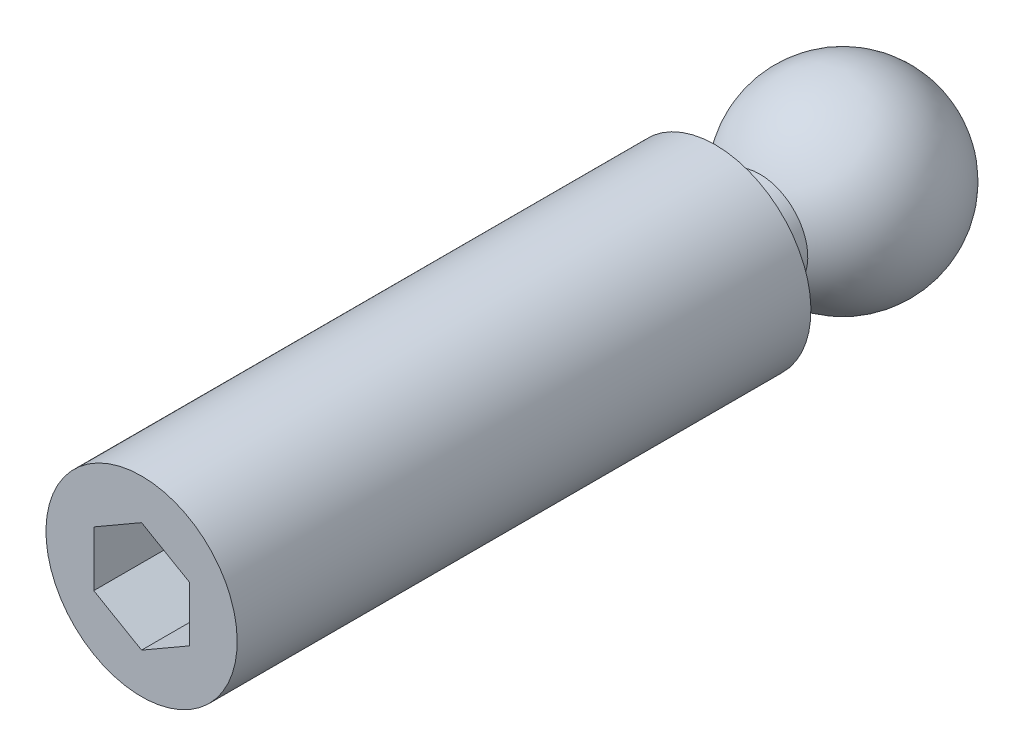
ISO-10303-21;
HEADER;
FILE_DESCRIPTION(('STEP AP214'),'2;1');
FILE_NAME('part.step','',(''),(''),'','','');
FILE_SCHEMA(('AUTOMOTIVE_DESIGN { 1 0 10303 214 1 1 1 1 }'));
ENDSEC;
DATA;
#1=APPLICATION_CONTEXT('core data for automotive mechanical design processes');
#2=APPLICATION_PROTOCOL_DEFINITION('international standard','automotive_design',2000,#1);
#3=PRODUCT_CONTEXT('',#1,'mechanical');
#4=PRODUCT('Part','Part','',(#3));
#5=PRODUCT_RELATED_PRODUCT_CATEGORY('part','',(#4));
#6=PRODUCT_DEFINITION_FORMATION('','',#4);
#7=PRODUCT_DEFINITION_CONTEXT('part definition',#1,'design');
#8=PRODUCT_DEFINITION('design','',#6,#7);
#9=PRODUCT_DEFINITION_SHAPE('','',#8);
#10=(LENGTH_UNIT() NAMED_UNIT(*) SI_UNIT(.MILLI.,.METRE.));
#11=(NAMED_UNIT(*) PLANE_ANGLE_UNIT() SI_UNIT($,.RADIAN.));
#12=(NAMED_UNIT(*) SI_UNIT($,.STERADIAN.) SOLID_ANGLE_UNIT());
#13=UNCERTAINTY_MEASURE_WITH_UNIT(LENGTH_MEASURE(1.E-05),#10,'distance_accuracy_value','');
#14=(GEOMETRIC_REPRESENTATION_CONTEXT(3) GLOBAL_UNCERTAINTY_ASSIGNED_CONTEXT((#13)) GLOBAL_UNIT_ASSIGNED_CONTEXT((#10,
#11,#12)) REPRESENTATION_CONTEXT('',''));
#15=CARTESIAN_POINT('',(0.,0.,0.));
#16=DIRECTION('',(0.,0.,1.));
#17=DIRECTION('',(1.,0.,0.));
#18=AXIS2_PLACEMENT_3D('',#15,#16,#17);
#19=CARTESIAN_POINT('',(0.,0.,3.));
#20=DIRECTION('',(0.,-1.,0.));
#21=DIRECTION('',(-1.,0.,0.));
#22=AXIS2_PLACEMENT_3D('',#19,#20,#21);
#23=SPHERICAL_SURFACE('',#22,3.);
#24=CARTESIAN_POINT('',(0.,0.,3.));
#25=DIRECTION('',(0.,0.,1.));
#26=DIRECTION('',(0.,1.,0.));
#27=AXIS2_PLACEMENT_3D('',#24,#25,#26);
#28=SPHERICAL_SURFACE('',#27,3.);
#29=CARTESIAN_POINT('',(0.,0.,5.59807621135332));
#30=DIRECTION('',(0.,0.,1.));
#31=DIRECTION('',(0.,1.,0.));
#32=AXIS2_PLACEMENT_3D('',#29,#30,#31);
#33=CIRCLE('',#32,1.5);
#34=CARTESIAN_POINT('',(0.,1.5,5.59807621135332));
#35=VERTEX_POINT('',#34);
#36=EDGE_CURVE('E9',#35,#35,#33,.T.);
#37=ORIENTED_EDGE('',*,*,#36,.F.);
#38=EDGE_LOOP('',(#37));
#39=FACE_BOUND('',#38,.T.);
#40=ADVANCED_FACE('F14',(#39),#28,.T.);
#41=CARTESIAN_POINT('',(0.,0.,30.));
#42=DIRECTION('',(0.,0.,1.));
#43=DIRECTION('',(0.,1.,0.));
#44=AXIS2_PLACEMENT_3D('',#41,#42,#43);
#45=CYLINDRICAL_SURFACE('',#44,1.5);
#46=ORIENTED_EDGE('',*,*,#36,.T.);
#47=EDGE_LOOP('',(#46));
#48=FACE_BOUND('',#47,.T.);
#49=CARTESIAN_POINT('',(0.,0.,7.));
#50=DIRECTION('',(0.,0.,1.));
#51=DIRECTION('',(0.,1.,0.));
#52=AXIS2_PLACEMENT_3D('',#49,#50,#51);
#53=CIRCLE('',#52,1.5);
#54=CARTESIAN_POINT('',(0.,1.5,7.));
#55=VERTEX_POINT('',#54);
#56=EDGE_CURVE('E21',#55,#55,#53,.T.);
#57=ORIENTED_EDGE('',*,*,#56,.F.);
#58=EDGE_LOOP('',(#57));
#59=FACE_BOUND('',#58,.T.);
#60=ADVANCED_FACE('F131',(#48,#59),#45,.T.);
#61=CARTESIAN_POINT('',(0.,-3.,7.));
#62=DIRECTION('',(0.,0.,-1.));
#63=DIRECTION('',(0.,-1.,0.));
#64=AXIS2_PLACEMENT_3D('',#61,#62,#63);
#65=PLANE('',#64);
#66=ORIENTED_EDGE('',*,*,#56,.T.);
#67=EDGE_LOOP('',(#66));
#68=FACE_BOUND('',#67,.T.);
#69=CARTESIAN_POINT('',(0.,0.,7.));
#70=DIRECTION('',(0.,0.,1.));
#71=DIRECTION('',(0.,1.,0.));
#72=AXIS2_PLACEMENT_3D('',#69,#70,#71);
#73=CIRCLE('',#72,3.);
#74=CARTESIAN_POINT('',(0.,3.,7.));
#75=VERTEX_POINT('',#74);
#76=EDGE_CURVE('E123',#75,#75,#73,.T.);
#77=ORIENTED_EDGE('',*,*,#76,.F.);
#78=EDGE_LOOP('',(#77));
#79=FACE_BOUND('',#78,.T.);
#80=ADVANCED_FACE('F128',(#68,#79),#65,.T.);
#81=CARTESIAN_POINT('',(0.,0.,30.));
#82=DIRECTION('',(0.,0.,1.));
#83=DIRECTION('',(0.,1.,0.));
#84=AXIS2_PLACEMENT_3D('',#81,#82,#83);
#85=CYLINDRICAL_SURFACE('',#84,3.);
#86=ORIENTED_EDGE('',*,*,#76,.T.);
#87=EDGE_LOOP('',(#86));
#88=FACE_BOUND('',#87,.T.);
#89=CARTESIAN_POINT('',(0.,0.,25.));
#90=DIRECTION('',(0.,0.,1.));
#91=DIRECTION('',(0.,1.,0.));
#92=AXIS2_PLACEMENT_3D('',#89,#90,#91);
#93=CIRCLE('',#92,3.);
#94=CARTESIAN_POINT('',(0.,3.,25.));
#95=VERTEX_POINT('',#94);
#96=EDGE_CURVE('E115',#95,#95,#93,.T.);
#97=ORIENTED_EDGE('',*,*,#96,.F.);
#98=EDGE_LOOP('',(#97));
#99=FACE_BOUND('',#98,.T.);
#100=ADVANCED_FACE('F139',(#88,#99),#85,.T.);
#101=CARTESIAN_POINT('',(0.,0.,25.));
#102=DIRECTION('',(0.,0.,1.));
#103=DIRECTION('',(0.,1.,0.));
#104=AXIS2_PLACEMENT_3D('',#101,#102,#103);
#105=PLANE('',#104);
#106=DIRECTION('',(-0.866025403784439,0.5,0.));
#107=VECTOR('',#106,1.);
#108=CARTESIAN_POINT('',(1.5,0.86602540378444,25.));
#109=LINE('',#108,#107);
#110=CARTESIAN_POINT('',(1.5,0.86602540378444,25.));
#111=VERTEX_POINT('',#110);
#112=CARTESIAN_POINT('',(0.,1.73205080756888,25.));
#113=VERTEX_POINT('',#112);
#114=EDGE_CURVE('E28',#111,#113,#109,.T.);
#115=ORIENTED_EDGE('',*,*,#114,.F.);
#116=DIRECTION('',(0.,1.,0.));
#117=VECTOR('',#116,1.);
#118=CARTESIAN_POINT('',(1.5,-0.866025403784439,25.));
#119=LINE('',#118,#117);
#120=CARTESIAN_POINT('',(1.5,-0.866025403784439,25.));
#121=VERTEX_POINT('',#120);
#122=EDGE_CURVE('E111',#121,#111,#119,.T.);
#123=ORIENTED_EDGE('',*,*,#122,.F.);
#124=DIRECTION('',(0.866025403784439,0.5,0.));
#125=VECTOR('',#124,1.);
#126=CARTESIAN_POINT('',(0.,-1.73205080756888,25.));
#127=LINE('',#126,#125);
#128=CARTESIAN_POINT('',(0.,-1.73205080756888,25.));
#129=VERTEX_POINT('',#128);
#130=EDGE_CURVE('E109',#129,#121,#127,.T.);
#131=ORIENTED_EDGE('',*,*,#130,.F.);
#132=DIRECTION('',(0.866025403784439,-0.5,0.));
#133=VECTOR('',#132,1.);
#134=CARTESIAN_POINT('',(-1.5,-0.866025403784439,25.));
#135=LINE('',#134,#133);
#136=CARTESIAN_POINT('',(-1.5,-0.866025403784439,25.));
#137=VERTEX_POINT('',#136);
#138=EDGE_CURVE('E76',#137,#129,#135,.T.);
#139=ORIENTED_EDGE('',*,*,#138,.F.);
#140=DIRECTION('',(0.,-1.,0.));
#141=VECTOR('',#140,1.);
#142=CARTESIAN_POINT('',(-1.5,0.866025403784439,25.));
#143=LINE('',#142,#141);
#144=CARTESIAN_POINT('',(-1.5,0.866025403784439,25.));
#145=VERTEX_POINT('',#144);
#146=EDGE_CURVE('E105',#145,#137,#143,.T.);
#147=ORIENTED_EDGE('',*,*,#146,.F.);
#148=DIRECTION('',(-0.866025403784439,-0.5,0.));
#149=VECTOR('',#148,1.);
#150=CARTESIAN_POINT('',(0.,1.73205080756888,25.));
#151=LINE('',#150,#149);
#152=EDGE_CURVE('E102',#113,#145,#151,.T.);
#153=ORIENTED_EDGE('',*,*,#152,.F.);
#154=EDGE_LOOP('',(#115,#123,#131,#139,#147,#153));
#155=FACE_BOUND('',#154,.T.);
#156=ORIENTED_EDGE('',*,*,#96,.T.);
#157=EDGE_LOOP('',(#156));
#158=FACE_BOUND('',#157,.T.);
#159=ADVANCED_FACE('F145',(#155,#158),#105,.T.);
#160=CARTESIAN_POINT('',(1.5,0.86602540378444,21.));
#161=DIRECTION('',(0.5,0.866025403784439,0.));
#162=DIRECTION('',(-0.866025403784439,0.5,0.));
#163=AXIS2_PLACEMENT_3D('',#160,#161,#162);
#164=PLANE('',#163);
#165=ORIENTED_EDGE('',*,*,#114,.T.);
#166=DIRECTION('',(0.,0.,1.));
#167=VECTOR('',#166,1.);
#168=CARTESIAN_POINT('',(0.,1.73205080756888,21.));
#169=LINE('',#168,#167);
#170=CARTESIAN_POINT('',(0.,1.73205080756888,21.));
#171=VERTEX_POINT('',#170);
#172=EDGE_CURVE('E58',#171,#113,#169,.T.);
#173=ORIENTED_EDGE('',*,*,#172,.F.);
#174=DIRECTION('',(-0.866025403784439,0.5,0.));
#175=VECTOR('',#174,1.);
#176=CARTESIAN_POINT('',(1.5,0.86602540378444,21.));
#177=LINE('',#176,#175);
#178=CARTESIAN_POINT('',(1.5,0.86602540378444,21.));
#179=VERTEX_POINT('',#178);
#180=EDGE_CURVE('E113',#179,#171,#177,.T.);
#181=ORIENTED_EDGE('',*,*,#180,.F.);
#182=DIRECTION('',(0.,0.,1.));
#183=VECTOR('',#182,1.);
#184=CARTESIAN_POINT('',(1.5,0.86602540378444,21.));
#185=LINE('',#184,#183);
#186=EDGE_CURVE('E36',#179,#111,#185,.T.);
#187=ORIENTED_EDGE('',*,*,#186,.T.);
#188=EDGE_LOOP('',(#165,#173,#181,#187));
#189=FACE_BOUND('',#188,.T.);
#190=ADVANCED_FACE('F149',(#189),#164,.F.);
#191=CARTESIAN_POINT('',(1.5,-0.866025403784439,21.));
#192=DIRECTION('',(1.,0.,0.));
#193=DIRECTION('',(0.,0.,-1.));
#194=AXIS2_PLACEMENT_3D('',#191,#192,#193);
#195=PLANE('',#194);
#196=ORIENTED_EDGE('',*,*,#122,.T.);
#197=ORIENTED_EDGE('',*,*,#186,.F.);
#198=DIRECTION('',(0.,1.,0.));
#199=VECTOR('',#198,1.);
#200=CARTESIAN_POINT('',(1.5,-0.866025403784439,21.));
#201=LINE('',#200,#199);
#202=CARTESIAN_POINT('',(1.5,-0.866025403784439,21.));
#203=VERTEX_POINT('',#202);
#204=EDGE_CURVE('E88',#203,#179,#201,.T.);
#205=ORIENTED_EDGE('',*,*,#204,.F.);
#206=DIRECTION('',(0.,0.,1.));
#207=VECTOR('',#206,1.);
#208=CARTESIAN_POINT('',(1.5,-0.866025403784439,21.));
#209=LINE('',#208,#207);
#210=EDGE_CURVE('E80',#203,#121,#209,.T.);
#211=ORIENTED_EDGE('',*,*,#210,.T.);
#212=EDGE_LOOP('',(#196,#197,#205,#211));
#213=FACE_BOUND('',#212,.T.);
#214=ADVANCED_FACE('F153',(#213),#195,.F.);
#215=CARTESIAN_POINT('',(0.,-1.73205080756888,21.));
#216=DIRECTION('',(0.5,-0.866025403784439,0.));
#217=DIRECTION('',(0.866025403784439,0.5,0.));
#218=AXIS2_PLACEMENT_3D('',#215,#216,#217);
#219=PLANE('',#218);
#220=ORIENTED_EDGE('',*,*,#130,.T.);
#221=ORIENTED_EDGE('',*,*,#210,.F.);
#222=DIRECTION('',(0.866025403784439,0.5,0.));
#223=VECTOR('',#222,1.);
#224=CARTESIAN_POINT('',(0.,-1.73205080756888,21.));
#225=LINE('',#224,#223);
#226=CARTESIAN_POINT('',(0.,-1.73205080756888,21.));
#227=VERTEX_POINT('',#226);
#228=EDGE_CURVE('E84',#227,#203,#225,.T.);
#229=ORIENTED_EDGE('',*,*,#228,.F.);
#230=DIRECTION('',(0.,0.,1.));
#231=VECTOR('',#230,1.);
#232=CARTESIAN_POINT('',(0.,-1.73205080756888,21.));
#233=LINE('',#232,#231);
#234=EDGE_CURVE('E69',#227,#129,#233,.T.);
#235=ORIENTED_EDGE('',*,*,#234,.T.);
#236=EDGE_LOOP('',(#220,#221,#229,#235));
#237=FACE_BOUND('',#236,.T.);
#238=ADVANCED_FACE('F85',(#237),#219,.F.);
#239=CARTESIAN_POINT('',(-1.5,-0.866025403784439,21.));
#240=DIRECTION('',(-0.5,-0.866025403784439,0.));
#241=DIRECTION('',(0.866025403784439,-0.5,0.));
#242=AXIS2_PLACEMENT_3D('',#239,#240,#241);
#243=PLANE('',#242);
#244=ORIENTED_EDGE('',*,*,#138,.T.);
#245=ORIENTED_EDGE('',*,*,#234,.F.);
#246=DIRECTION('',(0.866025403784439,-0.5,0.));
#247=VECTOR('',#246,1.);
#248=CARTESIAN_POINT('',(-1.5,-0.866025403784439,21.));
#249=LINE('',#248,#247);
#250=CARTESIAN_POINT('',(-1.5,-0.866025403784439,21.));
#251=VERTEX_POINT('',#250);
#252=EDGE_CURVE('E73',#251,#227,#249,.T.);
#253=ORIENTED_EDGE('',*,*,#252,.F.);
#254=DIRECTION('',(0.,0.,1.));
#255=VECTOR('',#254,1.);
#256=CARTESIAN_POINT('',(-1.5,-0.866025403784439,21.));
#257=LINE('',#256,#255);
#258=EDGE_CURVE('E81',#251,#137,#257,.T.);
#259=ORIENTED_EDGE('',*,*,#258,.T.);
#260=EDGE_LOOP('',(#244,#245,#253,#259));
#261=FACE_BOUND('',#260,.T.);
#262=ADVANCED_FACE('F71',(#261),#243,.F.);
#263=CARTESIAN_POINT('',(-1.5,0.866025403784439,21.));
#264=DIRECTION('',(-1.,0.,0.));
#265=DIRECTION('',(0.,-1.,0.));
#266=AXIS2_PLACEMENT_3D('',#263,#264,#265);
#267=PLANE('',#266);
#268=ORIENTED_EDGE('',*,*,#146,.T.);
#269=ORIENTED_EDGE('',*,*,#258,.F.);
#270=DIRECTION('',(0.,-1.,0.));
#271=VECTOR('',#270,1.);
#272=CARTESIAN_POINT('',(-1.5,0.866025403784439,21.));
#273=LINE('',#272,#271);
#274=CARTESIAN_POINT('',(-1.5,0.866025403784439,21.));
#275=VERTEX_POINT('',#274);
#276=EDGE_CURVE('E94',#275,#251,#273,.T.);
#277=ORIENTED_EDGE('',*,*,#276,.F.);
#278=DIRECTION('',(0.,0.,1.));
#279=VECTOR('',#278,1.);
#280=CARTESIAN_POINT('',(-1.5,0.866025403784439,21.));
#281=LINE('',#280,#279);
#282=EDGE_CURVE('E118',#275,#145,#281,.T.);
#283=ORIENTED_EDGE('',*,*,#282,.T.);
#284=EDGE_LOOP('',(#268,#269,#277,#283));
#285=FACE_BOUND('',#284,.T.);
#286=ADVANCED_FACE('F157',(#285),#267,.F.);
#287=CARTESIAN_POINT('',(0.,1.73205080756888,21.));
#288=DIRECTION('',(-0.5,0.866025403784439,0.));
#289=DIRECTION('',(-0.866025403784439,-0.5,0.));
#290=AXIS2_PLACEMENT_3D('',#287,#288,#289);
#291=PLANE('',#290);
#292=ORIENTED_EDGE('',*,*,#152,.T.);
#293=ORIENTED_EDGE('',*,*,#282,.F.);
#294=DIRECTION('',(-0.866025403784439,-0.5,0.));
#295=VECTOR('',#294,1.);
#296=CARTESIAN_POINT('',(0.,1.73205080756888,21.));
#297=LINE('',#296,#295);
#298=EDGE_CURVE('E96',#171,#275,#297,.T.);
#299=ORIENTED_EDGE('',*,*,#298,.F.);
#300=ORIENTED_EDGE('',*,*,#172,.T.);
#301=EDGE_LOOP('',(#292,#293,#299,#300));
#302=FACE_BOUND('',#301,.T.);
#303=ADVANCED_FACE('F154',(#302),#291,.F.);
#304=CARTESIAN_POINT('',(0.,1.73205080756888,21.));
#305=DIRECTION('',(0.,0.,1.));
#306=DIRECTION('',(1.,0.,0.));
#307=AXIS2_PLACEMENT_3D('',#304,#305,#306);
#308=PLANE('',#307);
#309=ORIENTED_EDGE('',*,*,#180,.T.);
#310=ORIENTED_EDGE('',*,*,#298,.T.);
#311=ORIENTED_EDGE('',*,*,#276,.T.);
#312=ORIENTED_EDGE('',*,*,#252,.T.);
#313=ORIENTED_EDGE('',*,*,#228,.T.);
#314=ORIENTED_EDGE('',*,*,#204,.T.);
#315=EDGE_LOOP('',(#309,#310,#311,#312,#313,#314));
#316=FACE_BOUND('',#315,.T.);
#317=ADVANCED_FACE('F91',(#316),#308,.T.);
#318=CLOSED_SHELL('',(#40,#60,#80,#100,#159,#190,#214,#238,#262,#286,#303,#317));
#319=MANIFOLD_SOLID_BREP('B1',#318);
#320=ADVANCED_BREP_SHAPE_REPRESENTATION('',(#18,#319),#14);
#321=SHAPE_DEFINITION_REPRESENTATION(#9,#320);
ENDSEC;
END-ISO-10303-21;
